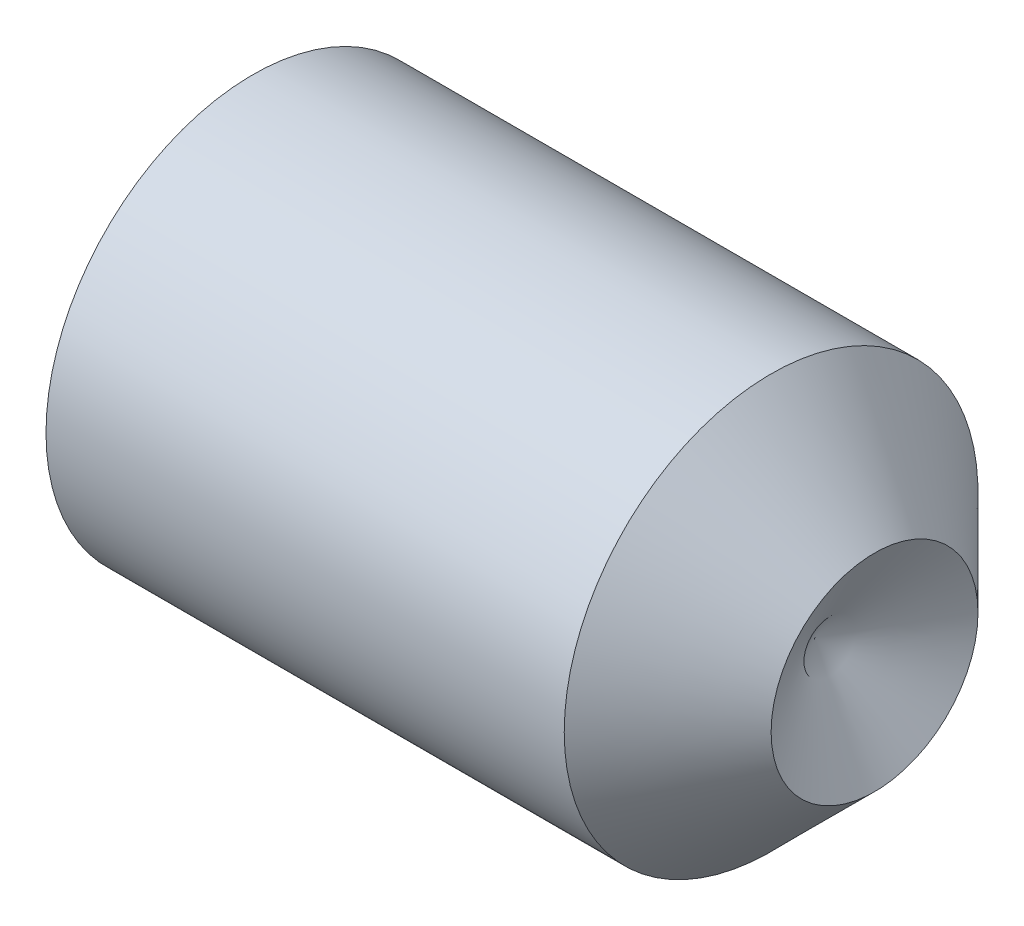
ISO-10303-21;
HEADER;
FILE_DESCRIPTION(('STEP AP214'),'2;1');
FILE_NAME('part.step','',(''),(''),'','','');
FILE_SCHEMA(('AUTOMOTIVE_DESIGN { 1 0 10303 214 1 1 1 1 }'));
ENDSEC;
DATA;
#1=APPLICATION_CONTEXT('core data for automotive mechanical design processes');
#2=APPLICATION_PROTOCOL_DEFINITION('international standard','automotive_design',2000,#1);
#3=PRODUCT_CONTEXT('',#1,'mechanical');
#4=PRODUCT('Part','Part','',(#3));
#5=PRODUCT_RELATED_PRODUCT_CATEGORY('part','',(#4));
#6=PRODUCT_DEFINITION_FORMATION('','',#4);
#7=PRODUCT_DEFINITION_CONTEXT('part definition',#1,'design');
#8=PRODUCT_DEFINITION('design','',#6,#7);
#9=PRODUCT_DEFINITION_SHAPE('','',#8);
#10=(LENGTH_UNIT() NAMED_UNIT(*) SI_UNIT(.MILLI.,.METRE.));
#11=(NAMED_UNIT(*) PLANE_ANGLE_UNIT() SI_UNIT($,.RADIAN.));
#12=(NAMED_UNIT(*) SI_UNIT($,.STERADIAN.) SOLID_ANGLE_UNIT());
#13=UNCERTAINTY_MEASURE_WITH_UNIT(LENGTH_MEASURE(1.E-05),#10,'distance_accuracy_value','');
#14=(GEOMETRIC_REPRESENTATION_CONTEXT(3) GLOBAL_UNCERTAINTY_ASSIGNED_CONTEXT((#13)) GLOBAL_UNIT_ASSIGNED_CONTEXT((#10,
#11,#12)) REPRESENTATION_CONTEXT('',''));
#15=CARTESIAN_POINT('',(0.,0.,0.));
#16=DIRECTION('',(0.,0.,1.));
#17=DIRECTION('',(1.,0.,0.));
#18=AXIS2_PLACEMENT_3D('',#15,#16,#17);
#19=CARTESIAN_POINT('',(0.,0.,0.));
#20=DIRECTION('',(-1.,0.,0.));
#21=DIRECTION('',(0.,0.,1.));
#22=AXIS2_PLACEMENT_3D('',#19,#20,#21);
#23=PLANE('',#22);
#24=CARTESIAN_POINT('',(0.,0.,0.));
#25=DIRECTION('',(-1.,0.,0.));
#26=DIRECTION('',(0.,0.,1.));
#27=AXIS2_PLACEMENT_3D('',#24,#25,#26);
#28=CIRCLE('',#27,1.655);
#29=CARTESIAN_POINT('',(0.,0.,1.655));
#30=VERTEX_POINT('',#29);
#31=EDGE_CURVE('E11',#30,#30,#28,.T.);
#32=ORIENTED_EDGE('',*,*,#31,.T.);
#33=EDGE_LOOP('',(#32));
#34=FACE_BOUND('',#33,.T.);
#35=DIRECTION('',(0.,0.,-1.));
#36=VECTOR('',#35,1.);
#37=CARTESIAN_POINT('',(0.,1.25,0.721687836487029));
#38=LINE('',#37,#36);
#39=CARTESIAN_POINT('',(0.,1.25,0.721687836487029));
#40=VERTEX_POINT('',#39);
#41=CARTESIAN_POINT('',(0.,1.25,-0.721687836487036));
#42=VERTEX_POINT('',#41);
#43=EDGE_CURVE('E97',#40,#42,#38,.T.);
#44=ORIENTED_EDGE('',*,*,#43,.F.);
#45=DIRECTION('',(0.,-0.866025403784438,0.5));
#46=VECTOR('',#45,1.);
#47=CARTESIAN_POINT('',(0.,1.25,0.721687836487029));
#48=LINE('',#47,#46);
#49=CARTESIAN_POINT('',(0.,0.,1.44337567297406));
#50=VERTEX_POINT('',#49);
#51=EDGE_CURVE('E50',#40,#50,#48,.T.);
#52=ORIENTED_EDGE('',*,*,#51,.T.);
#53=DIRECTION('',(0.,0.866025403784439,0.5));
#54=VECTOR('',#53,1.);
#55=CARTESIAN_POINT('',(0.,-1.25,0.721687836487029));
#56=LINE('',#55,#54);
#57=CARTESIAN_POINT('',(0.,-1.25,0.721687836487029));
#58=VERTEX_POINT('',#57);
#59=EDGE_CURVE('E103',#58,#50,#56,.T.);
#60=ORIENTED_EDGE('',*,*,#59,.F.);
#61=DIRECTION('',(0.,0.,-1.));
#62=VECTOR('',#61,1.);
#63=CARTESIAN_POINT('',(0.,-1.25,0.721687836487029));
#64=LINE('',#63,#62);
#65=CARTESIAN_POINT('',(0.,-1.25,-0.721687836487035));
#66=VERTEX_POINT('',#65);
#67=EDGE_CURVE('E123',#58,#66,#64,.T.);
#68=ORIENTED_EDGE('',*,*,#67,.T.);
#69=DIRECTION('',(0.,0.866025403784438,-0.500000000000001));
#70=VECTOR('',#69,1.);
#71=CARTESIAN_POINT('',(0.,-1.25,-0.721687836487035));
#72=LINE('',#71,#70);
#73=CARTESIAN_POINT('',(0.,0.,-1.44337567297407));
#74=VERTEX_POINT('',#73);
#75=EDGE_CURVE('E126',#66,#74,#72,.T.);
#76=ORIENTED_EDGE('',*,*,#75,.T.);
#77=DIRECTION('',(0.,-0.866025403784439,-0.5));
#78=VECTOR('',#77,1.);
#79=CARTESIAN_POINT('',(0.,1.25,-0.721687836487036));
#80=LINE('',#79,#78);
#81=EDGE_CURVE('E129',#42,#74,#80,.T.);
#82=ORIENTED_EDGE('',*,*,#81,.F.);
#83=EDGE_LOOP('',(#44,#52,#60,#68,#76,#82));
#84=FACE_BOUND('',#83,.T.);
#85=ADVANCED_FACE('F36',(#34,#84),#23,.T.);
#86=CARTESIAN_POINT('',(0.,0.,0.));
#87=DIRECTION('',(1.,0.,0.));
#88=DIRECTION('',(0.,0.,-1.));
#89=AXIS2_PLACEMENT_3D('',#86,#87,#88);
#90=CONICAL_SURFACE('',#89,1.655,1.04719755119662);
#91=CARTESIAN_POINT('',(0.487860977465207,0.,0.));
#92=DIRECTION('',(-1.,0.,0.));
#93=DIRECTION('',(0.,0.,1.));
#94=AXIS2_PLACEMENT_3D('',#91,#92,#93);
#95=CIRCLE('',#94,2.5);
#96=CARTESIAN_POINT('',(0.487860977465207,0.,2.5));
#97=VERTEX_POINT('',#96);
#98=EDGE_CURVE('E43',#97,#97,#95,.T.);
#99=ORIENTED_EDGE('',*,*,#98,.T.);
#100=EDGE_LOOP('',(#99));
#101=FACE_BOUND('',#100,.T.);
#102=ORIENTED_EDGE('',*,*,#31,.F.);
#103=EDGE_LOOP('',(#102));
#104=FACE_BOUND('',#103,.T.);
#105=ADVANCED_FACE('F149',(#101,#104),#90,.T.);
#106=CARTESIAN_POINT('',(-12.7,0.,0.));
#107=DIRECTION('',(-1.,0.,0.));
#108=DIRECTION('',(0.,0.,1.));
#109=AXIS2_PLACEMENT_3D('',#106,#107,#108);
#110=CYLINDRICAL_SURFACE('',#109,2.5);
#111=CARTESIAN_POINT('',(6.75,0.,0.));
#112=DIRECTION('',(-1.,0.,0.));
#113=DIRECTION('',(0.,0.,1.));
#114=AXIS2_PLACEMENT_3D('',#111,#112,#113);
#115=CIRCLE('',#114,2.5);
#116=CARTESIAN_POINT('',(6.75,0.,2.5));
#117=VERTEX_POINT('',#116);
#118=EDGE_CURVE('E144',#117,#117,#115,.T.);
#119=ORIENTED_EDGE('',*,*,#118,.T.);
#120=EDGE_LOOP('',(#119));
#121=FACE_BOUND('',#120,.T.);
#122=ORIENTED_EDGE('',*,*,#98,.F.);
#123=EDGE_LOOP('',(#122));
#124=FACE_BOUND('',#123,.T.);
#125=ADVANCED_FACE('F152',(#121,#124),#110,.T.);
#126=CARTESIAN_POINT('',(6.75,0.,0.));
#127=DIRECTION('',(-1.,0.,0.));
#128=DIRECTION('',(0.,0.,1.));
#129=AXIS2_PLACEMENT_3D('',#126,#127,#128);
#130=CONICAL_SURFACE('',#129,2.5,0.785398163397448);
#131=CARTESIAN_POINT('',(8.,0.,0.));
#132=DIRECTION('',(-1.,0.,0.));
#133=DIRECTION('',(0.,0.,1.));
#134=AXIS2_PLACEMENT_3D('',#131,#132,#133);
#135=CIRCLE('',#134,1.25);
#136=CARTESIAN_POINT('',(8.,0.,1.25));
#137=VERTEX_POINT('',#136);
#138=EDGE_CURVE('E104',#137,#137,#135,.T.);
#139=ORIENTED_EDGE('',*,*,#138,.T.);
#140=EDGE_LOOP('',(#139));
#141=FACE_BOUND('',#140,.T.);
#142=ORIENTED_EDGE('',*,*,#118,.F.);
#143=EDGE_LOOP('',(#142));
#144=FACE_BOUND('',#143,.T.);
#145=ADVANCED_FACE('F154',(#141,#144),#130,.T.);
#146=CARTESIAN_POINT('',(7.27831216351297,0.,0.));
#147=DIRECTION('',(1.,0.,0.));
#148=DIRECTION('',(0.,0.,-1.));
#149=AXIS2_PLACEMENT_3D('',#146,#147,#148);
#150=CONICAL_SURFACE('',#149,0.,1.0471975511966);
#151=ORIENTED_EDGE('',*,*,#138,.F.);
#152=EDGE_LOOP('',(#151));
#153=FACE_BOUND('',#152,.T.);
#154=CARTESIAN_POINT('',(7.27831216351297,0.,0.));
#155=VERTEX_POINT('',#154);
#156=VERTEX_LOOP('',#155);
#157=FACE_BOUND('',#156,.T.);
#158=ADVANCED_FACE('F161',(#153,#157),#150,.F.);
#159=CARTESIAN_POINT('',(3.,1.25,0.721687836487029));
#160=DIRECTION('',(0.,-0.5,-0.866025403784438));
#161=DIRECTION('',(0.,0.866025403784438,-0.5));
#162=AXIS2_PLACEMENT_3D('',#159,#160,#161);
#163=PLANE('',#162);
#164=ORIENTED_EDGE('',*,*,#51,.F.);
#165=DIRECTION('',(-1.,0.,0.));
#166=VECTOR('',#165,1.);
#167=CARTESIAN_POINT('',(3.,1.25,0.721687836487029));
#168=LINE('',#167,#166);
#169=CARTESIAN_POINT('',(3.,1.25,0.721687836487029));
#170=VERTEX_POINT('',#169);
#171=EDGE_CURVE('E91',#170,#40,#168,.T.);
#172=ORIENTED_EDGE('',*,*,#171,.F.);
#173=DIRECTION('',(0.,-0.866025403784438,0.5));
#174=VECTOR('',#173,1.);
#175=CARTESIAN_POINT('',(3.,1.25,0.721687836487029));
#176=LINE('',#175,#174);
#177=CARTESIAN_POINT('',(3.,0.,1.44337567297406));
#178=VERTEX_POINT('',#177);
#179=EDGE_CURVE('E86',#170,#178,#176,.T.);
#180=ORIENTED_EDGE('',*,*,#179,.T.);
#181=DIRECTION('',(-1.,0.,0.));
#182=VECTOR('',#181,1.);
#183=CARTESIAN_POINT('',(3.,0.,1.44337567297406));
#184=LINE('',#183,#182);
#185=EDGE_CURVE('E89',#178,#50,#184,.T.);
#186=ORIENTED_EDGE('',*,*,#185,.T.);
#187=EDGE_LOOP('',(#164,#172,#180,#186));
#188=FACE_BOUND('',#187,.T.);
#189=ADVANCED_FACE('F88',(#188),#163,.T.);
#190=CARTESIAN_POINT('',(3.,-1.25,0.721687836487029));
#191=DIRECTION('',(0.,-0.5,0.866025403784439));
#192=DIRECTION('',(0.,-0.866025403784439,-0.5));
#193=AXIS2_PLACEMENT_3D('',#190,#191,#192);
#194=PLANE('',#193);
#195=ORIENTED_EDGE('',*,*,#59,.T.);
#196=ORIENTED_EDGE('',*,*,#185,.F.);
#197=DIRECTION('',(0.,0.866025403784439,0.5));
#198=VECTOR('',#197,1.);
#199=CARTESIAN_POINT('',(3.,-1.25,0.721687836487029));
#200=LINE('',#199,#198);
#201=CARTESIAN_POINT('',(3.,-1.25,0.721687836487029));
#202=VERTEX_POINT('',#201);
#203=EDGE_CURVE('E96',#202,#178,#200,.T.);
#204=ORIENTED_EDGE('',*,*,#203,.F.);
#205=DIRECTION('',(-1.,0.,0.));
#206=VECTOR('',#205,1.);
#207=CARTESIAN_POINT('',(3.,-1.25,0.721687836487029));
#208=LINE('',#207,#206);
#209=EDGE_CURVE('E105',#202,#58,#208,.T.);
#210=ORIENTED_EDGE('',*,*,#209,.T.);
#211=EDGE_LOOP('',(#195,#196,#204,#210));
#212=FACE_BOUND('',#211,.T.);
#213=ADVANCED_FACE('F101',(#212),#194,.F.);
#214=CARTESIAN_POINT('',(3.,-1.25,0.721687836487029));
#215=DIRECTION('',(0.,1.,0.));
#216=DIRECTION('',(0.,0.,1.));
#217=AXIS2_PLACEMENT_3D('',#214,#215,#216);
#218=PLANE('',#217);
#219=ORIENTED_EDGE('',*,*,#67,.F.);
#220=ORIENTED_EDGE('',*,*,#209,.F.);
#221=DIRECTION('',(0.,0.,-1.));
#222=VECTOR('',#221,1.);
#223=CARTESIAN_POINT('',(3.,-1.25,0.721687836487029));
#224=LINE('',#223,#222);
#225=CARTESIAN_POINT('',(3.,-1.25,-0.721687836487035));
#226=VERTEX_POINT('',#225);
#227=EDGE_CURVE('E110',#202,#226,#224,.T.);
#228=ORIENTED_EDGE('',*,*,#227,.T.);
#229=DIRECTION('',(-1.,0.,0.));
#230=VECTOR('',#229,1.);
#231=CARTESIAN_POINT('',(3.,-1.25,-0.721687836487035));
#232=LINE('',#231,#230);
#233=EDGE_CURVE('E139',#226,#66,#232,.T.);
#234=ORIENTED_EDGE('',*,*,#233,.T.);
#235=EDGE_LOOP('',(#219,#220,#228,#234));
#236=FACE_BOUND('',#235,.T.);
#237=ADVANCED_FACE('F184',(#236),#218,.T.);
#238=CARTESIAN_POINT('',(3.,-1.25,-0.721687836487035));
#239=DIRECTION('',(0.,0.500000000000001,0.866025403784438));
#240=DIRECTION('',(0.,-0.866025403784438,0.500000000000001));
#241=AXIS2_PLACEMENT_3D('',#238,#239,#240);
#242=PLANE('',#241);
#243=ORIENTED_EDGE('',*,*,#75,.F.);
#244=ORIENTED_EDGE('',*,*,#233,.F.);
#245=DIRECTION('',(0.,0.866025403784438,-0.500000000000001));
#246=VECTOR('',#245,1.);
#247=CARTESIAN_POINT('',(3.,-1.25,-0.721687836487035));
#248=LINE('',#247,#246);
#249=CARTESIAN_POINT('',(3.,0.,-1.44337567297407));
#250=VERTEX_POINT('',#249);
#251=EDGE_CURVE('E112',#226,#250,#248,.T.);
#252=ORIENTED_EDGE('',*,*,#251,.T.);
#253=DIRECTION('',(-1.,0.,0.));
#254=VECTOR('',#253,1.);
#255=CARTESIAN_POINT('',(3.,0.,-1.44337567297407));
#256=LINE('',#255,#254);
#257=EDGE_CURVE('E137',#250,#74,#256,.T.);
#258=ORIENTED_EDGE('',*,*,#257,.T.);
#259=EDGE_LOOP('',(#243,#244,#252,#258));
#260=FACE_BOUND('',#259,.T.);
#261=ADVANCED_FACE('F180',(#260),#242,.T.);
#262=CARTESIAN_POINT('',(3.,1.25,-0.721687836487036));
#263=DIRECTION('',(0.,0.5,-0.866025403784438));
#264=DIRECTION('',(0.,0.866025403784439,0.5));
#265=AXIS2_PLACEMENT_3D('',#262,#263,#264);
#266=PLANE('',#265);
#267=ORIENTED_EDGE('',*,*,#81,.T.);
#268=ORIENTED_EDGE('',*,*,#257,.F.);
#269=DIRECTION('',(0.,-0.866025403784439,-0.5));
#270=VECTOR('',#269,1.);
#271=CARTESIAN_POINT('',(3.,1.25,-0.721687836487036));
#272=LINE('',#271,#270);
#273=CARTESIAN_POINT('',(3.,1.25,-0.721687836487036));
#274=VERTEX_POINT('',#273);
#275=EDGE_CURVE('E116',#274,#250,#272,.T.);
#276=ORIENTED_EDGE('',*,*,#275,.F.);
#277=DIRECTION('',(-1.,0.,0.));
#278=VECTOR('',#277,1.);
#279=CARTESIAN_POINT('',(3.,1.25,-0.721687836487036));
#280=LINE('',#279,#278);
#281=EDGE_CURVE('E135',#274,#42,#280,.T.);
#282=ORIENTED_EDGE('',*,*,#281,.T.);
#283=EDGE_LOOP('',(#267,#268,#276,#282));
#284=FACE_BOUND('',#283,.T.);
#285=ADVANCED_FACE('F177',(#284),#266,.F.);
#286=CARTESIAN_POINT('',(3.,1.25,0.721687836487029));
#287=DIRECTION('',(0.,1.,0.));
#288=DIRECTION('',(0.,0.,1.));
#289=AXIS2_PLACEMENT_3D('',#286,#287,#288);
#290=PLANE('',#289);
#291=ORIENTED_EDGE('',*,*,#43,.T.);
#292=ORIENTED_EDGE('',*,*,#281,.F.);
#293=DIRECTION('',(0.,0.,-1.));
#294=VECTOR('',#293,1.);
#295=CARTESIAN_POINT('',(3.,1.25,0.721687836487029));
#296=LINE('',#295,#294);
#297=EDGE_CURVE('E119',#170,#274,#296,.T.);
#298=ORIENTED_EDGE('',*,*,#297,.F.);
#299=ORIENTED_EDGE('',*,*,#171,.T.);
#300=EDGE_LOOP('',(#291,#292,#298,#299));
#301=FACE_BOUND('',#300,.T.);
#302=ADVANCED_FACE('F173',(#301),#290,.F.);
#303=CARTESIAN_POINT('',(3.,2.5,0.));
#304=DIRECTION('',(1.,0.,0.));
#305=DIRECTION('',(0.,0.,-1.));
#306=AXIS2_PLACEMENT_3D('',#303,#304,#305);
#307=PLANE('',#306);
#308=ORIENTED_EDGE('',*,*,#179,.F.);
#309=ORIENTED_EDGE('',*,*,#297,.T.);
#310=ORIENTED_EDGE('',*,*,#275,.T.);
#311=ORIENTED_EDGE('',*,*,#251,.F.);
#312=ORIENTED_EDGE('',*,*,#227,.F.);
#313=ORIENTED_EDGE('',*,*,#203,.T.);
#314=EDGE_LOOP('',(#308,#309,#310,#311,#312,#313));
#315=FACE_BOUND('',#314,.T.);
#316=ADVANCED_FACE('F108',(#315),#307,.F.);
#317=CLOSED_SHELL('',(#85,#105,#125,#145,#158,#189,#213,#237,#261,#285,#302,#316));
#318=MANIFOLD_SOLID_BREP('B2',#317);
#319=ADVANCED_BREP_SHAPE_REPRESENTATION('',(#18,#318),#14);
#320=SHAPE_DEFINITION_REPRESENTATION(#9,#319);
ENDSEC;
END-ISO-10303-21;
